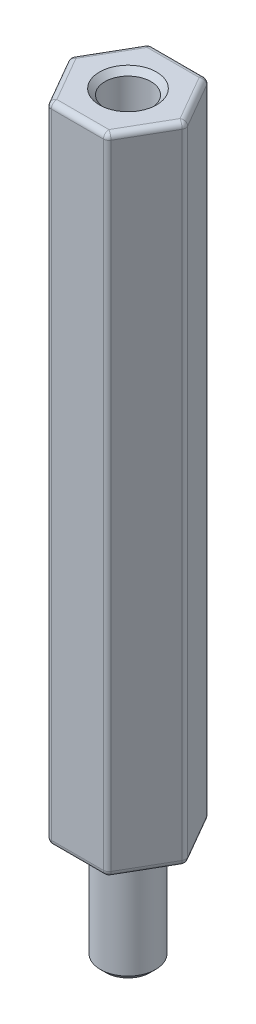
from build123d import *

# Parameters (mm, degrees)
SKETCH1_R           = 1.25
BOSS_EXTRUDE1_DEPTH = 35
FILLET1_R           = 0.3
FILLET2_R           = 0.3
SKETCH2_R           = 1.5
BOSS_EXTRUDE2_DEPTH = 6
CHAMFER1_SIZE       = 0.3
FILLET3_R           = 0.3


with BuildPart() as part:
    # Sketch1 → Boss-Extrude1 (new body)
    with BuildSketch(Plane(origin=(0, 0, 0), x_dir=(1, 0, 0), z_dir=(0, 1, 0))):
        Polygon((-1.58771324, 2.75), (-3.175426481, 0), (-1.58771324, -2.75), (1.58771324, -2.75), (3.175426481, 0), (1.58771324, 2.75), align=None)
        with Locations(Location((0, 0, 0), (0, 0, 270))):
            Circle(SKETCH1_R, mode=Mode.SUBTRACT)
    extrude(amount=BOSS_EXTRUDE1_DEPTH)

    # Fillet1
    fillet1_edges = [part.edges().sort_by_distance(p)[0] for p in [
        (1.58771324, 17.5, -2.75),
        (3.175426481, 17.5, 0),
        (1.58771324, 17.5, 2.75),
        (-1.58771324, 17.5, 2.75),
        (-3.175426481, 17.5, 0),
        (-1.58771324, 17.5, -2.75),
    ]]
    fillet(fillet1_edges, radius=FILLET1_R)

    # Fillet2
    fillet2_edges = [part.edges().sort_by_distance(p)[0] for p in [
        (0, 0, -2.75),
        (0, 35, -2.75),
        (2.38156986, 0, -1.375),
        (2.38156986, 0, 1.375),
        (0, 0, 2.75),
        (-2.38156986, 0, 1.375),
        (-2.38156986, 0, -1.375),
        (1.56450816, 0, 2.709807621),
        (-1.56450816, 0, 2.709807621),
        (-3.129016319, 0, 0),
        (-1.56450816, 0, -2.709807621),
        (3.129016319, 0, 0),
        (1.56450816, 0, -2.709807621),
        (2.38156986, 35, -1.375),
        (-2.38156986, 35, -1.375),
        (-2.38156986, 35, 1.375),
        (0, 35, 2.75),
        (2.38156986, 35, 1.375),
        (1.56450816, 35, 2.709807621),
        (-1.56450816, 35, 2.709807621),
        (-3.129016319, 35, 0),
        (-1.56450816, 35, -2.709807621),
        (3.129016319, 35, 0),
        (1.56450816, 35, -2.709807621),
    ]]
    fillet(fillet2_edges, radius=FILLET2_R)

    # Sketch2 → Boss-Extrude2 (add)
    with BuildSketch(Plane.XZ):
        with Locations(Location((0, 0, 0), (0, 0, 90))):
            Circle(SKETCH2_R)
    extrude(amount=BOSS_EXTRUDE2_DEPTH)

    # Chamfer1
    chamfer1_edges = [part.edges().sort_by_distance(p)[0] for p in [
        (0, -6, -1.5),
        (0, 35, -1.25),
    ]]
    chamfer(chamfer1_edges, length=CHAMFER1_SIZE)

    # Fillet3
    fillet3_edges = [part.edges().sort_by_distance(p)[0] for p in [
        (0, 0, -1.5),
    ]]
    fillet(fillet3_edges, radius=FILLET3_R)


solid = part.part
